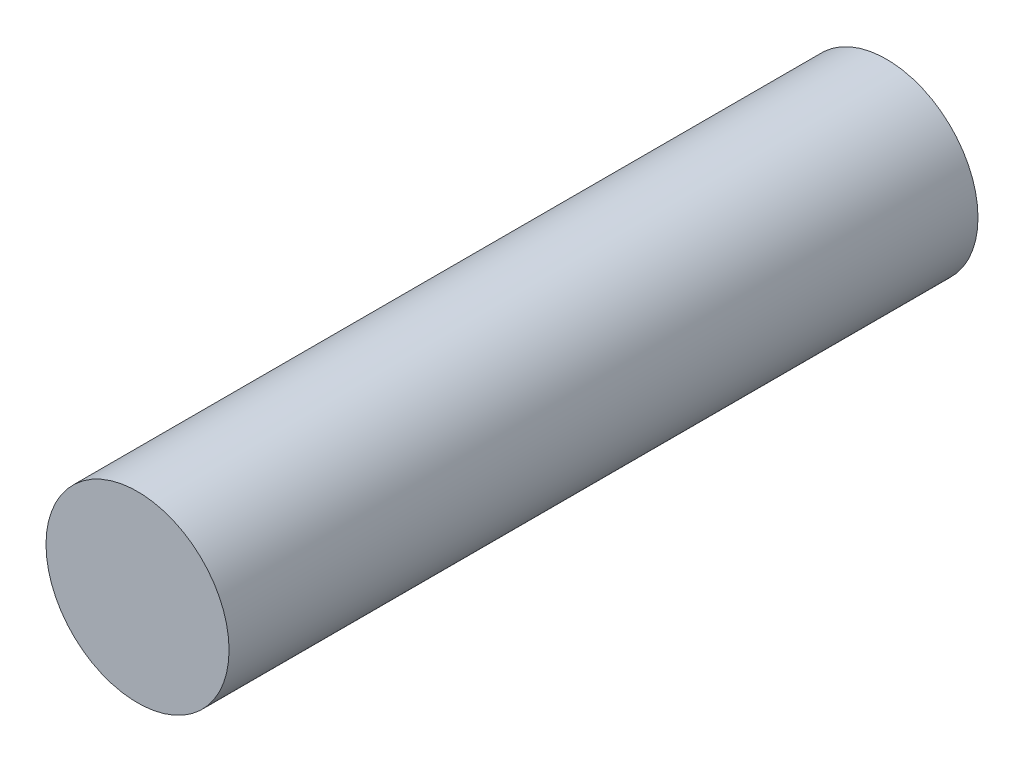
ISO-10303-21;
HEADER;
FILE_DESCRIPTION(('STEP AP214'),'2;1');
FILE_NAME('part.step','',(''),(''),'','','');
FILE_SCHEMA(('AUTOMOTIVE_DESIGN { 1 0 10303 214 1 1 1 1 }'));
ENDSEC;
DATA;
#1=APPLICATION_CONTEXT('core data for automotive mechanical design processes');
#2=APPLICATION_PROTOCOL_DEFINITION('international standard','automotive_design',2000,#1);
#3=PRODUCT_CONTEXT('',#1,'mechanical');
#4=PRODUCT('Part','Part','',(#3));
#5=PRODUCT_RELATED_PRODUCT_CATEGORY('part','',(#4));
#6=PRODUCT_DEFINITION_FORMATION('','',#4);
#7=PRODUCT_DEFINITION_CONTEXT('part definition',#1,'design');
#8=PRODUCT_DEFINITION('design','',#6,#7);
#9=PRODUCT_DEFINITION_SHAPE('','',#8);
#10=(LENGTH_UNIT() NAMED_UNIT(*) SI_UNIT(.MILLI.,.METRE.));
#11=(NAMED_UNIT(*) PLANE_ANGLE_UNIT() SI_UNIT($,.RADIAN.));
#12=(NAMED_UNIT(*) SI_UNIT($,.STERADIAN.) SOLID_ANGLE_UNIT());
#13=UNCERTAINTY_MEASURE_WITH_UNIT(LENGTH_MEASURE(1.E-05),#10,'distance_accuracy_value','');
#14=(GEOMETRIC_REPRESENTATION_CONTEXT(3) GLOBAL_UNCERTAINTY_ASSIGNED_CONTEXT((#13)) GLOBAL_UNIT_ASSIGNED_CONTEXT((#10,
#11,#12)) REPRESENTATION_CONTEXT('',''));
#15=CARTESIAN_POINT('',(0.,0.,0.));
#16=DIRECTION('',(0.,0.,1.));
#17=DIRECTION('',(1.,0.,0.));
#18=AXIS2_PLACEMENT_3D('',#15,#16,#17);
#19=CARTESIAN_POINT('',(0.,0.,-6.75));
#20=DIRECTION('',(0.,0.,-1.));
#21=DIRECTION('',(-1.,0.,0.));
#22=AXIS2_PLACEMENT_3D('',#19,#20,#21);
#23=CYLINDRICAL_SURFACE('',#22,1.65);
#24=CARTESIAN_POINT('',(0.,0.,-6.75));
#25=DIRECTION('',(0.,0.,-1.));
#26=DIRECTION('',(1.,0.,0.));
#27=AXIS2_PLACEMENT_3D('',#24,#25,#26);
#28=CIRCLE('',#27,1.65);
#29=CARTESIAN_POINT('',(1.65,0.,-6.75));
#30=VERTEX_POINT('',#29);
#31=EDGE_CURVE('E10',#30,#30,#28,.T.);
#32=ORIENTED_EDGE('',*,*,#31,.T.);
#33=EDGE_LOOP('',(#32));
#34=FACE_BOUND('',#33,.T.);
#35=CARTESIAN_POINT('',(0.,0.,-20.25));
#36=DIRECTION('',(0.,0.,-1.));
#37=DIRECTION('',(1.,0.,0.));
#38=AXIS2_PLACEMENT_3D('',#35,#36,#37);
#39=CIRCLE('',#38,1.65);
#40=CARTESIAN_POINT('',(1.65,0.,-20.25));
#41=VERTEX_POINT('',#40);
#42=EDGE_CURVE('E354',#41,#41,#39,.T.);
#43=ORIENTED_EDGE('',*,*,#42,.F.);
#44=EDGE_LOOP('',(#43));
#45=FACE_BOUND('',#44,.T.);
#46=ADVANCED_FACE('F348',(#34,#45),#23,.T.);
#47=CARTESIAN_POINT('',(0.,0.,-6.75));
#48=DIRECTION('',(0.,0.,1.));
#49=DIRECTION('',(1.,0.,0.));
#50=AXIS2_PLACEMENT_3D('',#47,#48,#49);
#51=PLANE('',#50);
#52=ORIENTED_EDGE('',*,*,#31,.F.);
#53=EDGE_LOOP('',(#52));
#54=FACE_BOUND('',#53,.T.);
#55=ADVANCED_FACE('F363',(#54),#51,.T.);
#56=CARTESIAN_POINT('',(0.,0.,-20.25));
#57=DIRECTION('',(0.,0.,1.));
#58=DIRECTION('',(1.,0.,0.));
#59=AXIS2_PLACEMENT_3D('',#56,#57,#58);
#60=PLANE('',#59);
#61=ORIENTED_EDGE('',*,*,#42,.T.);
#62=EDGE_LOOP('',(#61));
#63=FACE_BOUND('',#62,.T.);
#64=ADVANCED_FACE('F360',(#63),#60,.F.);
#65=CLOSED_SHELL('',(#46,#55,#64));
#66=MANIFOLD_SOLID_BREP('B2',#65);
#67=ADVANCED_BREP_SHAPE_REPRESENTATION('',(#18,#66),#14);
#68=SHAPE_DEFINITION_REPRESENTATION(#9,#67);
ENDSEC;
END-ISO-10303-21;
